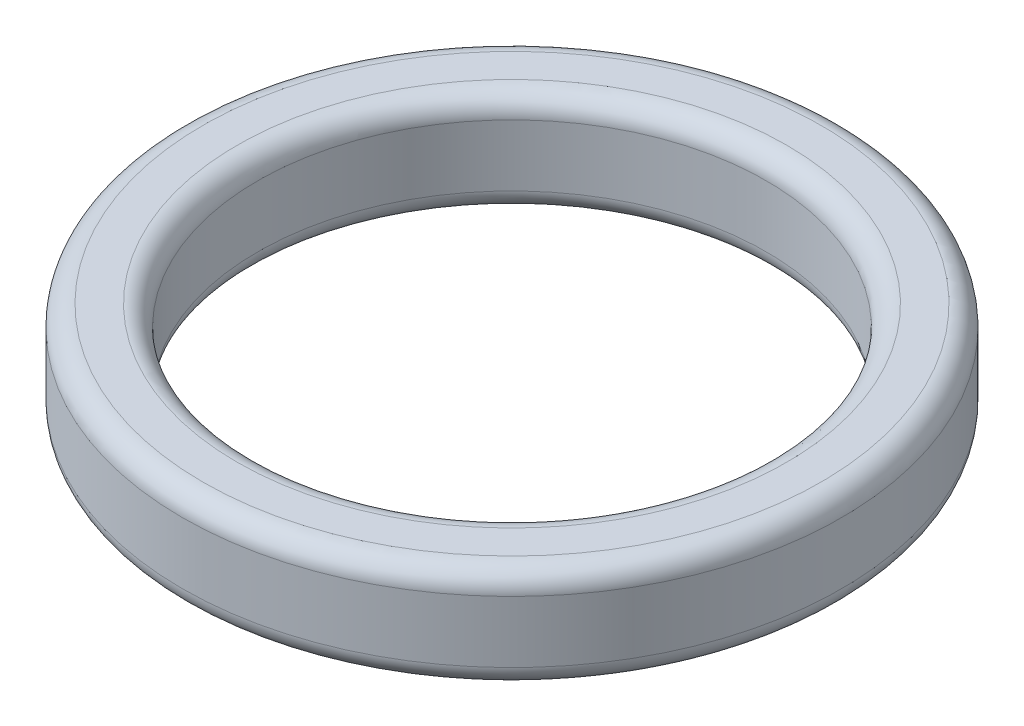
from build123d import *

# Parameters (mm, degrees)
SKETCH1_R      = 32.122013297
SKETCH1_R_2    = 24.775693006
EXTRUDE1_DEPTH = 10
FILLET1_R      = 2


with BuildPart() as part:
    # Sketch1 → Extrude1 (new body)
    with BuildSketch(Plane(origin=(0, 0, 0), x_dir=(1, 0, 0), z_dir=(0, 1, 0))):
        with Locations(Location((0, 0, 0), (0, 0, 270))):
            Circle(SKETCH1_R)
        with Locations(Location((0, 0, 0), (0, 0, 270))):
            Circle(SKETCH1_R_2, mode=Mode.SUBTRACT)
    extrude(amount=EXTRUDE1_DEPTH)

    # Fillet1
    fillet1_edges = [part.edges().sort_by_distance(p)[0] for p in [
        (0, 0, -32.122013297),
        (0, 10, -32.122013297),
        (0, 0, -24.775693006),
        (0, 10, -24.775693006),
    ]]
    fillet(fillet1_edges, radius=FILLET1_R)


solid = part.part
